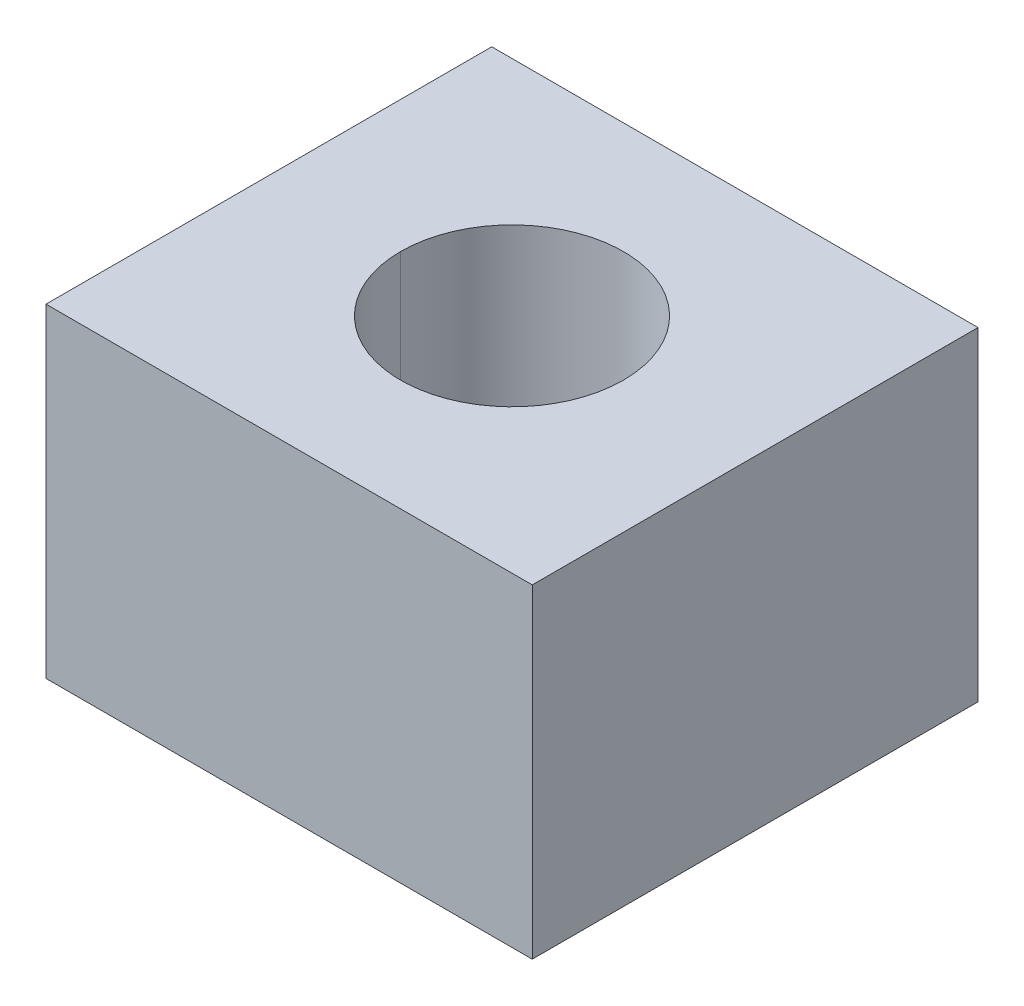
ISO-10303-21;
HEADER;
FILE_DESCRIPTION(('STEP AP214'),'2;1');
FILE_NAME('part.step','',(''),(''),'','','');
FILE_SCHEMA(('AUTOMOTIVE_DESIGN { 1 0 10303 214 1 1 1 1 }'));
ENDSEC;
DATA;
#1=APPLICATION_CONTEXT('core data for automotive mechanical design processes');
#2=APPLICATION_PROTOCOL_DEFINITION('international standard','automotive_design',2000,#1);
#3=PRODUCT_CONTEXT('',#1,'mechanical');
#4=PRODUCT('Part','Part','',(#3));
#5=PRODUCT_RELATED_PRODUCT_CATEGORY('part','',(#4));
#6=PRODUCT_DEFINITION_FORMATION('','',#4);
#7=PRODUCT_DEFINITION_CONTEXT('part definition',#1,'design');
#8=PRODUCT_DEFINITION('design','',#6,#7);
#9=PRODUCT_DEFINITION_SHAPE('','',#8);
#10=(LENGTH_UNIT() NAMED_UNIT(*) SI_UNIT(.MILLI.,.METRE.));
#11=(NAMED_UNIT(*) PLANE_ANGLE_UNIT() SI_UNIT($,.RADIAN.));
#12=(NAMED_UNIT(*) SI_UNIT($,.STERADIAN.) SOLID_ANGLE_UNIT());
#13=UNCERTAINTY_MEASURE_WITH_UNIT(LENGTH_MEASURE(1.E-05),#10,'distance_accuracy_value','');
#14=(GEOMETRIC_REPRESENTATION_CONTEXT(3) GLOBAL_UNCERTAINTY_ASSIGNED_CONTEXT((#13)) GLOBAL_UNIT_ASSIGNED_CONTEXT((#10,
#11,#12)) REPRESENTATION_CONTEXT('',''));
#15=CARTESIAN_POINT('',(0.,0.,0.));
#16=DIRECTION('',(0.,0.,1.));
#17=DIRECTION('',(1.,0.,0.));
#18=AXIS2_PLACEMENT_3D('',#15,#16,#17);
#19=CARTESIAN_POINT('',(12.7,-6.35000000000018,-7.93750000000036));
#20=DIRECTION('',(0.,0.,1.));
#21=DIRECTION('',(1.,0.,0.));
#22=AXIS2_PLACEMENT_3D('',#19,#20,#21);
#23=PLANE('',#22);
#24=CARTESIAN_POINT('',(12.7,-6.35000000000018,-7.93750000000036));
#25=DIRECTION('',(0.,0.,1.));
#26=DIRECTION('',(1.,0.,0.));
#27=AXIS2_PLACEMENT_3D('',#24,#25,#26);
#28=CIRCLE('',#27,1.9812);
#29=CARTESIAN_POINT('',(14.6812,-6.35000000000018,-7.93750000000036));
#30=VERTEX_POINT('',#29);
#31=CARTESIAN_POINT('',(10.7188,-6.35000000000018,-7.93750000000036));
#32=VERTEX_POINT('',#31);
#33=EDGE_CURVE('E19',#30,#32,#28,.F.);
#34=ORIENTED_EDGE('',*,*,#33,.T.);
#35=CARTESIAN_POINT('',(12.7,-6.35000000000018,-7.93750000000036));
#36=DIRECTION('',(0.,0.,1.));
#37=DIRECTION('',(1.,0.,0.));
#38=AXIS2_PLACEMENT_3D('',#35,#36,#37);
#39=CIRCLE('',#38,1.9812);
#40=EDGE_CURVE('E97',#32,#30,#39,.F.);
#41=ORIENTED_EDGE('',*,*,#40,.T.);
#42=EDGE_LOOP('',(#34,#41));
#43=FACE_BOUND('',#42,.T.);
#44=ADVANCED_FACE('F16',(#43),#23,.F.);
#45=CARTESIAN_POINT('',(-12.7,-6.35000000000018,-7.93750000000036));
#46=DIRECTION('',(0.,0.,1.));
#47=DIRECTION('',(1.,0.,0.));
#48=AXIS2_PLACEMENT_3D('',#45,#46,#47);
#49=PLANE('',#48);
#50=CARTESIAN_POINT('',(-12.7,-6.35000000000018,-7.93750000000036));
#51=DIRECTION('',(0.,0.,1.));
#52=DIRECTION('',(1.,0.,0.));
#53=AXIS2_PLACEMENT_3D('',#50,#51,#52);
#54=CIRCLE('',#53,1.9812);
#55=CARTESIAN_POINT('',(-10.7188,-6.35000000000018,-7.93750000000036));
#56=VERTEX_POINT('',#55);
#57=CARTESIAN_POINT('',(-14.6812,-6.35000000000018,-7.93750000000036));
#58=VERTEX_POINT('',#57);
#59=EDGE_CURVE('E113',#56,#58,#54,.F.);
#60=ORIENTED_EDGE('',*,*,#59,.T.);
#61=CARTESIAN_POINT('',(-12.7,-6.35000000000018,-7.93750000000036));
#62=DIRECTION('',(0.,0.,1.));
#63=DIRECTION('',(1.,0.,0.));
#64=AXIS2_PLACEMENT_3D('',#61,#62,#63);
#65=CIRCLE('',#64,1.9812);
#66=EDGE_CURVE('E118',#58,#56,#65,.F.);
#67=ORIENTED_EDGE('',*,*,#66,.T.);
#68=EDGE_LOOP('',(#60,#67));
#69=FACE_BOUND('',#68,.T.);
#70=ADVANCED_FACE('F306',(#69),#49,.F.);
#71=CARTESIAN_POINT('',(-12.7,6.35000000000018,-7.93750000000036));
#72=DIRECTION('',(0.,0.,1.));
#73=DIRECTION('',(1.,0.,0.));
#74=AXIS2_PLACEMENT_3D('',#71,#72,#73);
#75=PLANE('',#74);
#76=CARTESIAN_POINT('',(-12.7,6.35000000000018,-7.93750000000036));
#77=DIRECTION('',(0.,0.,1.));
#78=DIRECTION('',(1.,0.,0.));
#79=AXIS2_PLACEMENT_3D('',#76,#77,#78);
#80=CIRCLE('',#79,1.9812);
#81=CARTESIAN_POINT('',(-10.7188,6.35000000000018,-7.93750000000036));
#82=VERTEX_POINT('',#81);
#83=CARTESIAN_POINT('',(-14.6812,6.35000000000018,-7.93750000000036));
#84=VERTEX_POINT('',#83);
#85=EDGE_CURVE('E121',#82,#84,#80,.F.);
#86=ORIENTED_EDGE('',*,*,#85,.T.);
#87=CARTESIAN_POINT('',(-12.7,6.35000000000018,-7.93750000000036));
#88=DIRECTION('',(0.,0.,1.));
#89=DIRECTION('',(1.,0.,0.));
#90=AXIS2_PLACEMENT_3D('',#87,#88,#89);
#91=CIRCLE('',#90,1.9812);
#92=EDGE_CURVE('E124',#84,#82,#91,.F.);
#93=ORIENTED_EDGE('',*,*,#92,.T.);
#94=EDGE_LOOP('',(#86,#93));
#95=FACE_BOUND('',#94,.T.);
#96=ADVANCED_FACE('F303',(#95),#75,.F.);
#97=CARTESIAN_POINT('',(12.7,6.35000000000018,-7.93750000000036));
#98=DIRECTION('',(0.,0.,1.));
#99=DIRECTION('',(1.,0.,0.));
#100=AXIS2_PLACEMENT_3D('',#97,#98,#99);
#101=PLANE('',#100);
#102=CARTESIAN_POINT('',(12.7,6.35000000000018,-7.93750000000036));
#103=DIRECTION('',(0.,0.,1.));
#104=DIRECTION('',(1.,0.,0.));
#105=AXIS2_PLACEMENT_3D('',#102,#103,#104);
#106=CIRCLE('',#105,1.9812);
#107=CARTESIAN_POINT('',(14.6812,6.35000000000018,-7.93750000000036));
#108=VERTEX_POINT('',#107);
#109=CARTESIAN_POINT('',(10.7188,6.35000000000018,-7.93750000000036));
#110=VERTEX_POINT('',#109);
#111=EDGE_CURVE('E127',#108,#110,#106,.F.);
#112=ORIENTED_EDGE('',*,*,#111,.T.);
#113=CARTESIAN_POINT('',(12.7,6.35000000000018,-7.93750000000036));
#114=DIRECTION('',(0.,0.,1.));
#115=DIRECTION('',(1.,0.,0.));
#116=AXIS2_PLACEMENT_3D('',#113,#114,#115);
#117=CIRCLE('',#116,1.9812);
#118=EDGE_CURVE('E130',#110,#108,#117,.F.);
#119=ORIENTED_EDGE('',*,*,#118,.T.);
#120=EDGE_LOOP('',(#112,#119));
#121=FACE_BOUND('',#120,.T.);
#122=ADVANCED_FACE('F300',(#121),#101,.F.);
#123=CARTESIAN_POINT('',(12.7,-6.35000000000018,-12.7000000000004));
#124=DIRECTION('',(0.,0.,1.));
#125=DIRECTION('',(1.,0.,0.));
#126=AXIS2_PLACEMENT_3D('',#123,#124,#125);
#127=CYLINDRICAL_SURFACE('',#126,1.9812);
#128=CARTESIAN_POINT('',(12.7,-6.35000000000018,-17.4624999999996));
#129=DIRECTION('',(0.,0.,1.));
#130=DIRECTION('',(1.,0.,0.));
#131=AXIS2_PLACEMENT_3D('',#128,#129,#130);
#132=CIRCLE('',#131,1.9812);
#133=CARTESIAN_POINT('',(14.6812,-6.35000000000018,-17.4625));
#134=VERTEX_POINT('',#133);
#135=CARTESIAN_POINT('',(10.7188,-6.35000000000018,-17.4625));
#136=VERTEX_POINT('',#135);
#137=EDGE_CURVE('E106',#134,#136,#132,.F.);
#138=ORIENTED_EDGE('',*,*,#137,.T.);
#139=DIRECTION('',(0.,0.,1.));
#140=VECTOR('',#139,1.);
#141=CARTESIAN_POINT('',(10.7188,-6.35000000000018,-12.7000000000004));
#142=LINE('',#141,#140);
#143=EDGE_CURVE('E102',#136,#32,#142,.T.);
#144=ORIENTED_EDGE('',*,*,#143,.T.);
#145=ORIENTED_EDGE('',*,*,#33,.F.);
#146=DIRECTION('',(0.,0.,1.));
#147=VECTOR('',#146,1.);
#148=CARTESIAN_POINT('',(14.6812,-6.35000000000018,-12.7000000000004));
#149=LINE('',#148,#147);
#150=EDGE_CURVE('E112',#30,#134,#149,.F.);
#151=ORIENTED_EDGE('',*,*,#150,.T.);
#152=EDGE_LOOP('',(#138,#144,#145,#151));
#153=FACE_BOUND('',#152,.T.);
#154=ADVANCED_FACE('F104',(#153),#127,.F.);
#155=CARTESIAN_POINT('',(12.7,-6.35000000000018,-12.7000000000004));
#156=DIRECTION('',(0.,0.,1.));
#157=DIRECTION('',(1.,0.,0.));
#158=AXIS2_PLACEMENT_3D('',#155,#156,#157);
#159=CYLINDRICAL_SURFACE('',#158,1.9812);
#160=ORIENTED_EDGE('',*,*,#40,.F.);
#161=ORIENTED_EDGE('',*,*,#143,.F.);
#162=CARTESIAN_POINT('',(12.7,-6.35000000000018,-17.4625000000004));
#163=DIRECTION('',(0.,0.,1.));
#164=DIRECTION('',(1.,0.,0.));
#165=AXIS2_PLACEMENT_3D('',#162,#163,#164);
#166=CIRCLE('',#165,1.9812);
#167=EDGE_CURVE('E134',#136,#134,#166,.F.);
#168=ORIENTED_EDGE('',*,*,#167,.T.);
#169=ORIENTED_EDGE('',*,*,#150,.F.);
#170=EDGE_LOOP('',(#160,#161,#168,#169));
#171=FACE_BOUND('',#170,.T.);
#172=ADVANCED_FACE('F111',(#171),#159,.F.);
#173=CARTESIAN_POINT('',(-12.7,-6.35000000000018,-12.7000000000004));
#174=DIRECTION('',(0.,0.,1.));
#175=DIRECTION('',(1.,0.,0.));
#176=AXIS2_PLACEMENT_3D('',#173,#174,#175);
#177=CYLINDRICAL_SURFACE('',#176,1.9812);
#178=CARTESIAN_POINT('',(-12.7,-6.35000000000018,-17.4624999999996));
#179=DIRECTION('',(0.,0.,1.));
#180=DIRECTION('',(1.,0.,0.));
#181=AXIS2_PLACEMENT_3D('',#178,#179,#180);
#182=CIRCLE('',#181,1.9812);
#183=CARTESIAN_POINT('',(-10.7188,-6.35000000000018,-17.4625));
#184=VERTEX_POINT('',#183);
#185=CARTESIAN_POINT('',(-14.6812,-6.35000000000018,-17.4625));
#186=VERTEX_POINT('',#185);
#187=EDGE_CURVE('E137',#184,#186,#182,.F.);
#188=ORIENTED_EDGE('',*,*,#187,.T.);
#189=DIRECTION('',(0.,0.,1.));
#190=VECTOR('',#189,1.);
#191=CARTESIAN_POINT('',(-14.6812,-6.35000000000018,-12.7000000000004));
#192=LINE('',#191,#190);
#193=EDGE_CURVE('E117',#186,#58,#192,.T.);
#194=ORIENTED_EDGE('',*,*,#193,.T.);
#195=ORIENTED_EDGE('',*,*,#59,.F.);
#196=DIRECTION('',(0.,0.,1.));
#197=VECTOR('',#196,1.);
#198=CARTESIAN_POINT('',(-10.7188,-6.35000000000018,-12.7000000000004));
#199=LINE('',#198,#197);
#200=EDGE_CURVE('E120',#56,#184,#199,.F.);
#201=ORIENTED_EDGE('',*,*,#200,.T.);
#202=EDGE_LOOP('',(#188,#194,#195,#201));
#203=FACE_BOUND('',#202,.T.);
#204=ADVANCED_FACE('F291',(#203),#177,.F.);
#205=CARTESIAN_POINT('',(-12.7,-6.35000000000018,-12.7000000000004));
#206=DIRECTION('',(0.,0.,1.));
#207=DIRECTION('',(1.,0.,0.));
#208=AXIS2_PLACEMENT_3D('',#205,#206,#207);
#209=CYLINDRICAL_SURFACE('',#208,1.9812);
#210=ORIENTED_EDGE('',*,*,#66,.F.);
#211=ORIENTED_EDGE('',*,*,#193,.F.);
#212=CARTESIAN_POINT('',(-12.7,-6.35000000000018,-17.4625000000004));
#213=DIRECTION('',(0.,0.,1.));
#214=DIRECTION('',(1.,0.,0.));
#215=AXIS2_PLACEMENT_3D('',#212,#213,#214);
#216=CIRCLE('',#215,1.9812);
#217=EDGE_CURVE('E139',#186,#184,#216,.F.);
#218=ORIENTED_EDGE('',*,*,#217,.T.);
#219=ORIENTED_EDGE('',*,*,#200,.F.);
#220=EDGE_LOOP('',(#210,#211,#218,#219));
#221=FACE_BOUND('',#220,.T.);
#222=ADVANCED_FACE('F287',(#221),#209,.F.);
#223=CARTESIAN_POINT('',(-12.7,6.35000000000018,-12.7000000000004));
#224=DIRECTION('',(0.,0.,1.));
#225=DIRECTION('',(1.,0.,0.));
#226=AXIS2_PLACEMENT_3D('',#223,#224,#225);
#227=CYLINDRICAL_SURFACE('',#226,1.9812);
#228=CARTESIAN_POINT('',(-12.7,6.35000000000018,-17.4624999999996));
#229=DIRECTION('',(0.,0.,1.));
#230=DIRECTION('',(1.,0.,0.));
#231=AXIS2_PLACEMENT_3D('',#228,#229,#230);
#232=CIRCLE('',#231,1.9812);
#233=CARTESIAN_POINT('',(-10.7188,6.35000000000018,-17.4625));
#234=VERTEX_POINT('',#233);
#235=CARTESIAN_POINT('',(-14.6812,6.35000000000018,-17.4625));
#236=VERTEX_POINT('',#235);
#237=EDGE_CURVE('E142',#234,#236,#232,.F.);
#238=ORIENTED_EDGE('',*,*,#237,.T.);
#239=DIRECTION('',(0.,0.,1.));
#240=VECTOR('',#239,1.);
#241=CARTESIAN_POINT('',(-14.6812,6.35000000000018,-12.7000000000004));
#242=LINE('',#241,#240);
#243=EDGE_CURVE('E123',#236,#84,#242,.T.);
#244=ORIENTED_EDGE('',*,*,#243,.T.);
#245=ORIENTED_EDGE('',*,*,#85,.F.);
#246=DIRECTION('',(0.,0.,1.));
#247=VECTOR('',#246,1.);
#248=CARTESIAN_POINT('',(-10.7188,6.35000000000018,-12.7000000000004));
#249=LINE('',#248,#247);
#250=EDGE_CURVE('E126',#82,#234,#249,.F.);
#251=ORIENTED_EDGE('',*,*,#250,.T.);
#252=EDGE_LOOP('',(#238,#244,#245,#251));
#253=FACE_BOUND('',#252,.T.);
#254=ADVANCED_FACE('F283',(#253),#227,.F.);
#255=CARTESIAN_POINT('',(-12.7,6.35000000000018,-12.7000000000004));
#256=DIRECTION('',(0.,0.,1.));
#257=DIRECTION('',(1.,0.,0.));
#258=AXIS2_PLACEMENT_3D('',#255,#256,#257);
#259=CYLINDRICAL_SURFACE('',#258,1.9812);
#260=ORIENTED_EDGE('',*,*,#92,.F.);
#261=ORIENTED_EDGE('',*,*,#243,.F.);
#262=CARTESIAN_POINT('',(-12.7,6.35000000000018,-17.4625000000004));
#263=DIRECTION('',(0.,0.,1.));
#264=DIRECTION('',(1.,0.,0.));
#265=AXIS2_PLACEMENT_3D('',#262,#263,#264);
#266=CIRCLE('',#265,1.9812);
#267=EDGE_CURVE('E144',#236,#234,#266,.F.);
#268=ORIENTED_EDGE('',*,*,#267,.T.);
#269=ORIENTED_EDGE('',*,*,#250,.F.);
#270=EDGE_LOOP('',(#260,#261,#268,#269));
#271=FACE_BOUND('',#270,.T.);
#272=ADVANCED_FACE('F279',(#271),#259,.F.);
#273=CARTESIAN_POINT('',(12.7,6.35000000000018,-12.7000000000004));
#274=DIRECTION('',(0.,0.,1.));
#275=DIRECTION('',(1.,0.,0.));
#276=AXIS2_PLACEMENT_3D('',#273,#274,#275);
#277=CYLINDRICAL_SURFACE('',#276,1.9812);
#278=CARTESIAN_POINT('',(12.7,6.35000000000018,-17.4624999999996));
#279=DIRECTION('',(0.,0.,1.));
#280=DIRECTION('',(1.,0.,0.));
#281=AXIS2_PLACEMENT_3D('',#278,#279,#280);
#282=CIRCLE('',#281,1.9812);
#283=CARTESIAN_POINT('',(14.6812,6.35000000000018,-17.4625));
#284=VERTEX_POINT('',#283);
#285=CARTESIAN_POINT('',(10.7188,6.35000000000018,-17.4625));
#286=VERTEX_POINT('',#285);
#287=EDGE_CURVE('E147',#284,#286,#282,.F.);
#288=ORIENTED_EDGE('',*,*,#287,.T.);
#289=DIRECTION('',(0.,0.,1.));
#290=VECTOR('',#289,1.);
#291=CARTESIAN_POINT('',(10.7188,6.35000000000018,-12.7000000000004));
#292=LINE('',#291,#290);
#293=EDGE_CURVE('E129',#286,#110,#292,.T.);
#294=ORIENTED_EDGE('',*,*,#293,.T.);
#295=ORIENTED_EDGE('',*,*,#111,.F.);
#296=DIRECTION('',(0.,0.,1.));
#297=VECTOR('',#296,1.);
#298=CARTESIAN_POINT('',(14.6812,6.35000000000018,-12.7000000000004));
#299=LINE('',#298,#297);
#300=EDGE_CURVE('E132',#108,#284,#299,.F.);
#301=ORIENTED_EDGE('',*,*,#300,.T.);
#302=EDGE_LOOP('',(#288,#294,#295,#301));
#303=FACE_BOUND('',#302,.T.);
#304=ADVANCED_FACE('F273',(#303),#277,.F.);
#305=CARTESIAN_POINT('',(12.7,6.35000000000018,-12.7000000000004));
#306=DIRECTION('',(0.,0.,1.));
#307=DIRECTION('',(1.,0.,0.));
#308=AXIS2_PLACEMENT_3D('',#305,#306,#307);
#309=CYLINDRICAL_SURFACE('',#308,1.9812);
#310=ORIENTED_EDGE('',*,*,#118,.F.);
#311=ORIENTED_EDGE('',*,*,#293,.F.);
#312=CARTESIAN_POINT('',(12.7,6.35000000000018,-17.4625000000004));
#313=DIRECTION('',(0.,0.,1.));
#314=DIRECTION('',(1.,0.,0.));
#315=AXIS2_PLACEMENT_3D('',#312,#313,#314);
#316=CIRCLE('',#315,1.9812);
#317=EDGE_CURVE('E149',#286,#284,#316,.F.);
#318=ORIENTED_EDGE('',*,*,#317,.T.);
#319=ORIENTED_EDGE('',*,*,#300,.F.);
#320=EDGE_LOOP('',(#310,#311,#318,#319));
#321=FACE_BOUND('',#320,.T.);
#322=ADVANCED_FACE('F266',(#321),#309,.F.);
#323=CARTESIAN_POINT('',(0.,-12.7000000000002,3.60955709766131E-13));
#324=DIRECTION('',(0.,-1.,0.));
#325=DIRECTION('',(0.,0.,-1.));
#326=AXIS2_PLACEMENT_3D('',#323,#324,#325);
#327=PLANE('',#326);
#328=CARTESIAN_POINT('',(0.,-12.7000000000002,3.60955709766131E-13));
#329=DIRECTION('',(0.,1.,0.));
#330=DIRECTION('',(0.,0.,1.));
#331=AXIS2_PLACEMENT_3D('',#328,#329,#330);
#332=CIRCLE('',#331,8.73125);
#333=CARTESIAN_POINT('',(-8.73125,-12.7000000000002,3.59351858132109E-13));
#334=VERTEX_POINT('',#333);
#335=CARTESIAN_POINT('',(8.73125,-12.7000000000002,3.62559561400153E-13));
#336=VERTEX_POINT('',#335);
#337=EDGE_CURVE('E155',#334,#336,#332,.T.);
#338=ORIENTED_EDGE('',*,*,#337,.T.);
#339=CARTESIAN_POINT('',(0.,-12.7000000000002,3.60955709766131E-13));
#340=DIRECTION('',(0.,1.,0.));
#341=DIRECTION('',(0.,0.,1.));
#342=AXIS2_PLACEMENT_3D('',#339,#340,#341);
#343=CIRCLE('',#342,8.73125);
#344=EDGE_CURVE('E153',#336,#334,#343,.T.);
#345=ORIENTED_EDGE('',*,*,#344,.T.);
#346=EDGE_LOOP('',(#338,#345));
#347=FACE_BOUND('',#346,.T.);
#348=DIRECTION('',(0.,0.,1.));
#349=VECTOR('',#348,1.);
#350=CARTESIAN_POINT('',(19.05,-12.7000000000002,3.60955709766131E-13));
#351=LINE('',#350,#349);
#352=CARTESIAN_POINT('',(19.05,-12.7000000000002,-17.4624999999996));
#353=VERTEX_POINT('',#352);
#354=CARTESIAN_POINT('',(19.05,-12.7000000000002,17.4625000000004));
#355=VERTEX_POINT('',#354);
#356=EDGE_CURVE('E179',#353,#355,#351,.T.);
#357=ORIENTED_EDGE('',*,*,#356,.T.);
#358=DIRECTION('',(-1.,0.,0.));
#359=VECTOR('',#358,1.);
#360=CARTESIAN_POINT('',(0.,-12.7000000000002,17.4625000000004));
#361=LINE('',#360,#359);
#362=CARTESIAN_POINT('',(-19.05,-12.7000000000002,17.4625000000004));
#363=VERTEX_POINT('',#362);
#364=EDGE_CURVE('E173',#355,#363,#361,.T.);
#365=ORIENTED_EDGE('',*,*,#364,.T.);
#366=DIRECTION('',(0.,0.,1.));
#367=VECTOR('',#366,1.);
#368=CARTESIAN_POINT('',(-19.05,-12.7000000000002,3.60955709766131E-13));
#369=LINE('',#368,#367);
#370=CARTESIAN_POINT('',(-19.05,-12.7000000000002,-17.4624999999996));
#371=VERTEX_POINT('',#370);
#372=EDGE_CURVE('E170',#363,#371,#369,.F.);
#373=ORIENTED_EDGE('',*,*,#372,.T.);
#374=DIRECTION('',(1.,0.,0.));
#375=VECTOR('',#374,1.);
#376=CARTESIAN_POINT('',(0.,-12.7000000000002,-17.4624999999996));
#377=LINE('',#376,#375);
#378=EDGE_CURVE('E186',#371,#353,#377,.T.);
#379=ORIENTED_EDGE('',*,*,#378,.T.);
#380=EDGE_LOOP('',(#357,#365,#373,#379));
#381=FACE_BOUND('',#380,.T.);
#382=ADVANCED_FACE('F230',(#347,#381),#327,.T.);
#383=CARTESIAN_POINT('',(-19.05,1.80477854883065E-13,3.60955709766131E-13));
#384=DIRECTION('',(1.,0.,0.));
#385=DIRECTION('',(0.,1.,0.));
#386=AXIS2_PLACEMENT_3D('',#383,#384,#385);
#387=PLANE('',#386);
#388=ORIENTED_EDGE('',*,*,#372,.F.);
#389=DIRECTION('',(0.,1.,0.));
#390=VECTOR('',#389,1.);
#391=CARTESIAN_POINT('',(-19.05,1.80477854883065E-13,17.4625000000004));
#392=LINE('',#391,#390);
#393=CARTESIAN_POINT('',(-19.05,12.7000000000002,17.4625000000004));
#394=VERTEX_POINT('',#393);
#395=EDGE_CURVE('E176',#363,#394,#392,.T.);
#396=ORIENTED_EDGE('',*,*,#395,.T.);
#397=DIRECTION('',(0.,0.,1.));
#398=VECTOR('',#397,1.);
#399=CARTESIAN_POINT('',(-19.05,12.7000000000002,3.60955709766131E-13));
#400=LINE('',#399,#398);
#401=CARTESIAN_POINT('',(-19.05,12.7000000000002,-17.4624999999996));
#402=VERTEX_POINT('',#401);
#403=EDGE_CURVE('E194',#402,#394,#400,.T.);
#404=ORIENTED_EDGE('',*,*,#403,.F.);
#405=DIRECTION('',(0.,1.,0.));
#406=VECTOR('',#405,1.);
#407=CARTESIAN_POINT('',(-19.05,1.80477854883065E-13,-17.4624999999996));
#408=LINE('',#407,#406);
#409=EDGE_CURVE('E152',#402,#371,#408,.F.);
#410=ORIENTED_EDGE('',*,*,#409,.T.);
#411=EDGE_LOOP('',(#388,#396,#404,#410));
#412=FACE_BOUND('',#411,.T.);
#413=ADVANCED_FACE('F235',(#412),#387,.F.);
#414=CARTESIAN_POINT('',(0.,1.80477854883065E-13,17.4625000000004));
#415=DIRECTION('',(0.,0.,-1.));
#416=DIRECTION('',(-1.,0.,0.));
#417=AXIS2_PLACEMENT_3D('',#414,#415,#416);
#418=PLANE('',#417);
#419=ORIENTED_EDGE('',*,*,#364,.F.);
#420=DIRECTION('',(0.,-1.,0.));
#421=VECTOR('',#420,1.);
#422=CARTESIAN_POINT('',(19.05,1.80477854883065E-13,17.4625000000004));
#423=LINE('',#422,#421);
#424=CARTESIAN_POINT('',(19.05,12.7000000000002,17.4625000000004));
#425=VERTEX_POINT('',#424);
#426=EDGE_CURVE('E135',#355,#425,#423,.F.);
#427=ORIENTED_EDGE('',*,*,#426,.T.);
#428=DIRECTION('',(1.,0.,0.));
#429=VECTOR('',#428,1.);
#430=CARTESIAN_POINT('',(0.,12.7000000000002,17.4625000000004));
#431=LINE('',#430,#429);
#432=EDGE_CURVE('E198',#394,#425,#431,.T.);
#433=ORIENTED_EDGE('',*,*,#432,.F.);
#434=ORIENTED_EDGE('',*,*,#395,.F.);
#435=EDGE_LOOP('',(#419,#427,#433,#434));
#436=FACE_BOUND('',#435,.T.);
#437=ADVANCED_FACE('F237',(#436),#418,.F.);
#438=CARTESIAN_POINT('',(19.05,1.80477854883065E-13,3.60955709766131E-13));
#439=DIRECTION('',(-1.,0.,0.));
#440=DIRECTION('',(0.,-1.,0.));
#441=AXIS2_PLACEMENT_3D('',#438,#439,#440);
#442=PLANE('',#441);
#443=ORIENTED_EDGE('',*,*,#356,.F.);
#444=DIRECTION('',(0.,1.,0.));
#445=VECTOR('',#444,1.);
#446=CARTESIAN_POINT('',(19.05,1.80477854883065E-13,-17.4624999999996));
#447=LINE('',#446,#445);
#448=CARTESIAN_POINT('',(19.05,12.7000000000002,-17.4624999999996));
#449=VERTEX_POINT('',#448);
#450=EDGE_CURVE('E156',#353,#449,#447,.T.);
#451=ORIENTED_EDGE('',*,*,#450,.T.);
#452=DIRECTION('',(0.,0.,1.));
#453=VECTOR('',#452,1.);
#454=CARTESIAN_POINT('',(19.05,12.7000000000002,3.60955709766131E-13));
#455=LINE('',#454,#453);
#456=EDGE_CURVE('E201',#425,#449,#455,.F.);
#457=ORIENTED_EDGE('',*,*,#456,.F.);
#458=ORIENTED_EDGE('',*,*,#426,.F.);
#459=EDGE_LOOP('',(#443,#451,#457,#458));
#460=FACE_BOUND('',#459,.T.);
#461=ADVANCED_FACE('F238',(#460),#442,.F.);
#462=CARTESIAN_POINT('',(0.,1.80477854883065E-13,-17.4624999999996));
#463=DIRECTION('',(0.,0.,1.));
#464=DIRECTION('',(1.,0.,0.));
#465=AXIS2_PLACEMENT_3D('',#462,#463,#464);
#466=PLANE('',#465);
#467=ORIENTED_EDGE('',*,*,#378,.F.);
#468=ORIENTED_EDGE('',*,*,#409,.F.);
#469=DIRECTION('',(1.,0.,0.));
#470=VECTOR('',#469,1.);
#471=CARTESIAN_POINT('',(0.,12.7000000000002,-17.4624999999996));
#472=LINE('',#471,#470);
#473=EDGE_CURVE('E159',#449,#402,#472,.F.);
#474=ORIENTED_EDGE('',*,*,#473,.F.);
#475=ORIENTED_EDGE('',*,*,#450,.F.);
#476=EDGE_LOOP('',(#467,#468,#474,#475));
#477=FACE_BOUND('',#476,.T.);
#478=ORIENTED_EDGE('',*,*,#287,.F.);
#479=ORIENTED_EDGE('',*,*,#317,.F.);
#480=EDGE_LOOP('',(#478,#479));
#481=FACE_BOUND('',#480,.T.);
#482=ORIENTED_EDGE('',*,*,#237,.F.);
#483=ORIENTED_EDGE('',*,*,#267,.F.);
#484=EDGE_LOOP('',(#482,#483));
#485=FACE_BOUND('',#484,.T.);
#486=ORIENTED_EDGE('',*,*,#187,.F.);
#487=ORIENTED_EDGE('',*,*,#217,.F.);
#488=EDGE_LOOP('',(#486,#487));
#489=FACE_BOUND('',#488,.T.);
#490=ORIENTED_EDGE('',*,*,#137,.F.);
#491=ORIENTED_EDGE('',*,*,#167,.F.);
#492=EDGE_LOOP('',(#490,#491));
#493=FACE_BOUND('',#492,.T.);
#494=ADVANCED_FACE('F216',(#477,#481,#485,#489,#493),#466,.F.);
#495=CARTESIAN_POINT('',(0.,0.,3.60955709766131E-13));
#496=DIRECTION('',(0.,1.,0.));
#497=DIRECTION('',(0.,0.,1.));
#498=AXIS2_PLACEMENT_3D('',#495,#496,#497);
#499=CYLINDRICAL_SURFACE('',#498,8.73125);
#500=ORIENTED_EDGE('',*,*,#344,.F.);
#501=DIRECTION('',(0.,1.,0.));
#502=VECTOR('',#501,1.);
#503=CARTESIAN_POINT('',(8.73125,0.,3.61490326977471E-13));
#504=LINE('',#503,#502);
#505=CARTESIAN_POINT('',(8.73125,12.7000000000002,3.62559561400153E-13));
#506=VERTEX_POINT('',#505);
#507=EDGE_CURVE('E34',#336,#506,#504,.T.);
#508=ORIENTED_EDGE('',*,*,#507,.T.);
#509=CARTESIAN_POINT('',(0.,12.7000000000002,3.60955709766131E-13));
#510=DIRECTION('',(0.,1.,0.));
#511=DIRECTION('',(0.,0.,1.));
#512=AXIS2_PLACEMENT_3D('',#509,#510,#511);
#513=CIRCLE('',#512,8.73125);
#514=CARTESIAN_POINT('',(-8.73125,12.7000000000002,3.59351858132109E-13));
#515=VERTEX_POINT('',#514);
#516=EDGE_CURVE('E25',#515,#506,#513,.F.);
#517=ORIENTED_EDGE('',*,*,#516,.F.);
#518=DIRECTION('',(0.,1.,0.));
#519=VECTOR('',#518,1.);
#520=CARTESIAN_POINT('',(-8.73125,0.,3.59351858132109E-13));
#521=LINE('',#520,#519);
#522=EDGE_CURVE('E191',#515,#334,#521,.F.);
#523=ORIENTED_EDGE('',*,*,#522,.T.);
#524=EDGE_LOOP('',(#500,#508,#517,#523));
#525=FACE_BOUND('',#524,.T.);
#526=ADVANCED_FACE('F246',(#525),#499,.F.);
#527=CARTESIAN_POINT('',(0.,0.,3.60955709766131E-13));
#528=DIRECTION('',(0.,1.,0.));
#529=DIRECTION('',(0.,0.,1.));
#530=AXIS2_PLACEMENT_3D('',#527,#528,#529);
#531=CYLINDRICAL_SURFACE('',#530,8.73125);
#532=CARTESIAN_POINT('',(0.,12.7000000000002,3.60955709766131E-13));
#533=DIRECTION('',(0.,1.,0.));
#534=DIRECTION('',(0.,0.,1.));
#535=AXIS2_PLACEMENT_3D('',#532,#533,#534);
#536=CIRCLE('',#535,8.73125);
#537=EDGE_CURVE('E11',#506,#515,#536,.F.);
#538=ORIENTED_EDGE('',*,*,#537,.F.);
#539=ORIENTED_EDGE('',*,*,#507,.F.);
#540=ORIENTED_EDGE('',*,*,#337,.F.);
#541=ORIENTED_EDGE('',*,*,#522,.F.);
#542=EDGE_LOOP('',(#538,#539,#540,#541));
#543=FACE_BOUND('',#542,.T.);
#544=ADVANCED_FACE('F250',(#543),#531,.F.);
#545=CARTESIAN_POINT('',(0.,12.7000000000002,3.60955709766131E-13));
#546=DIRECTION('',(0.,1.,0.));
#547=DIRECTION('',(0.,0.,1.));
#548=AXIS2_PLACEMENT_3D('',#545,#546,#547);
#549=PLANE('',#548);
#550=ORIENTED_EDGE('',*,*,#516,.T.);
#551=ORIENTED_EDGE('',*,*,#537,.T.);
#552=EDGE_LOOP('',(#550,#551));
#553=FACE_BOUND('',#552,.T.);
#554=ORIENTED_EDGE('',*,*,#456,.T.);
#555=ORIENTED_EDGE('',*,*,#473,.T.);
#556=ORIENTED_EDGE('',*,*,#403,.T.);
#557=ORIENTED_EDGE('',*,*,#432,.T.);
#558=EDGE_LOOP('',(#554,#555,#556,#557));
#559=FACE_BOUND('',#558,.T.);
#560=ADVANCED_FACE('F207',(#553,#559),#549,.T.);
#561=CLOSED_SHELL('',(#44,#70,#96,#122,#154,#172,#204,#222,#254,#272,#304,#322,#382,#413,#437,
#461,#494,#526,#544,#560));
#562=MANIFOLD_SOLID_BREP('B1',#561);
#563=ADVANCED_BREP_SHAPE_REPRESENTATION('',(#18,#562),#14);
#564=SHAPE_DEFINITION_REPRESENTATION(#9,#563);
ENDSEC;
END-ISO-10303-21;
